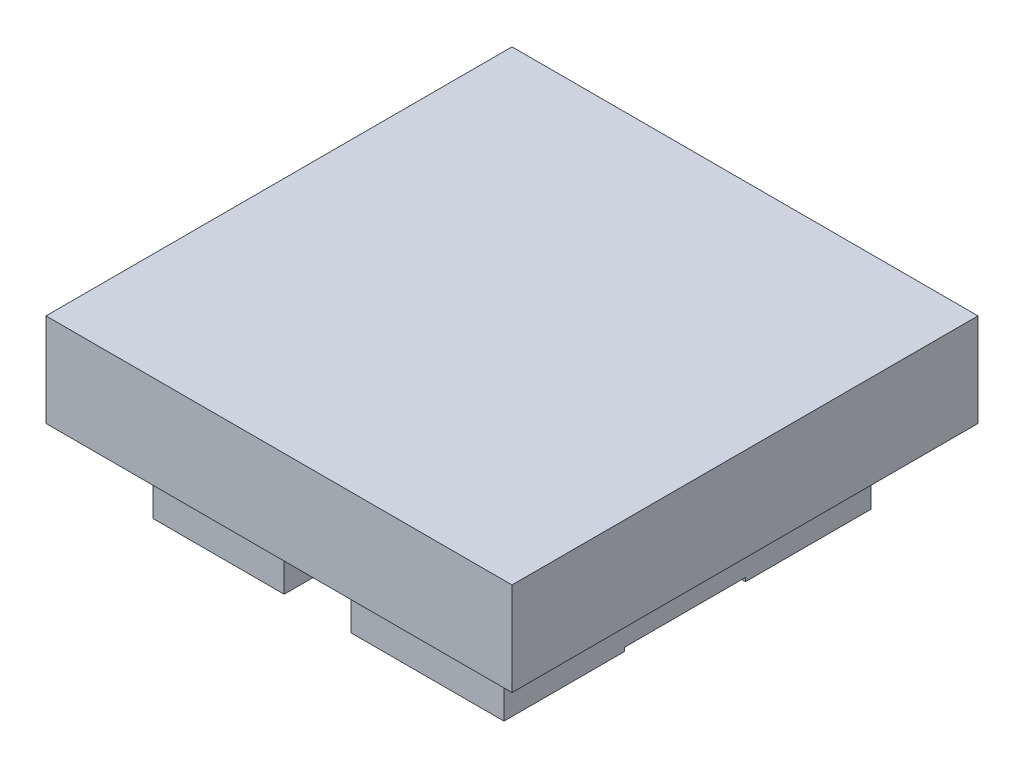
from build123d import *

# Parameters (mm, degrees)
ESQUISSE1_W             = 250
ESQUISSE1_H             = 50
BOSS_EXTRU_1_DEPTH      = 250
ESQUISSE2_W             = 70.34274314
ESQUISSE2_H             = 196.85846821
ESQUISSE2_W_2           = 81.982189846
BOSS_EXTRU_2_DEPTH      = 40
ESQUISSE3_W             = 344.628835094
ESQUISSE3_H             = 64.776051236
ENL_V_MAT_EXTRU_1_DEPTH = 2
BOSS_EXTRU_3_DEPTH      = 1
BOSS_EXTRU_3_DEPTH_BACK = 12
ESQUISSE4_W             = 58.197233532
ESQUISSE4_H             = 40.485032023
ESQUISSE4_W_2           = 8.603069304
ESQUISSE4_H_2           = 16.700075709
ESQUISSE4_W_3           = 24.797082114
ESQUISSE4_H_3           = 8.350037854
ESQUISSE4_H_4           = 9.615195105


with BuildPart() as part:
    # Esquisse1 → Boss.-Extru.1 (new body)
    with BuildSketch(Plane.XY):
        with Locations((125, 25)):
            Rectangle(ESQUISSE1_W, ESQUISSE1_H)
    extrude(amount=BOSS_EXTRU_1_DEPTH)

    # Esquisse2 → Boss.-Extru.2 (add)
    with BuildSketch(Plane.XZ):
        with Locations((68.067923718, 127.024251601)):
            Rectangle(ESQUISSE2_W, ESQUISSE2_H)
        with Locations((180.160856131, 127.024251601)):
            Rectangle(ESQUISSE2_W_2, ESQUISSE2_H)
    extrude(amount=BOSS_EXTRU_2_DEPTH)

    # Esquisse3 → Enl_v. mat.-Extru.1 (cut)
    with BuildSketch(Plane.XZ.offset(40)):
        with Locations((98.431697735, 128.289408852)):
            Rectangle(ESQUISSE3_W, ESQUISSE3_H)
    extrude(amount=-ENL_V_MAT_EXTRU_1_DEPTH, mode=Mode.SUBTRACT)

    # Esquisse4 → Boss.-Extru.3 (add, two sides: drawn at the far end of the back side and taken through both)
    with BuildSketch(Plane.XZ.offset(40).offset(-BOSS_EXTRU_3_DEPTH_BACK)):
        with Locations((180.413887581, 191.547271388)):
            Rectangle(ESQUISSE4_W, ESQUISSE4_H)
        with Locations((205.210969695, 145.242516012)):
            Rectangle(ESQUISSE4_W_2, ESQUISSE4_H_2)
        with Locations((69.080049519, 141.067497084)):
            Rectangle(ESQUISSE4_W_3, ESQUISSE4_H_3)
        with Locations((69.080049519, 127.530314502)):
            Rectangle(ESQUISSE4_W_3, ESQUISSE4_H_4)
    extrude(amount=BOSS_EXTRU_3_DEPTH + BOSS_EXTRU_3_DEPTH_BACK)


solid = part.part
